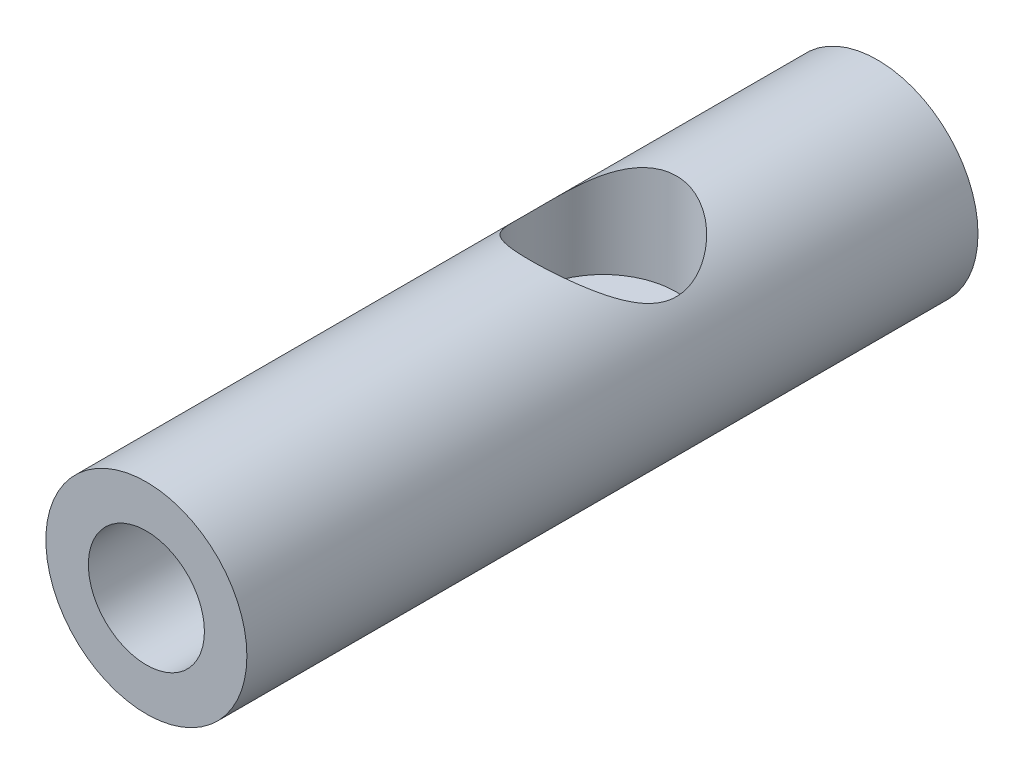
from build123d import *

# Parameters (mm, degrees)
SKETCH1_R           = 5.5
BOSS_EXTRUDE1_DEPTH = 20
SKETCH2_R           = 4
CUT_EXTRUDE1_DEPTH  = 22.459263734
SKETCH3_R           = 3.175
CUT_EXTRUDE2_DEPTH  = 5.7
SKETCH4_R           = 3.2
CUT_EXTRUDE3_DEPTH  = 3


with BuildPart() as part:
    # Sketch1 → Boss-Extrude1 (new, symmetric)
    with BuildSketch(Plane.XY):
        Circle(SKETCH1_R)
    extrude(amount=BOSS_EXTRUDE1_DEPTH, both=True)

    # Sketch2 → Cut-Extrude1 (cut, through all)
    with BuildSketch(Plane(origin=(0, 0, 0), x_dir=(1, 0, 0), z_dir=(0, 1, 0))):
        with Locations(Location((0, 5, 0), (0, 0, 90))):
            Circle(SKETCH2_R)
    extrude(amount=CUT_EXTRUDE1_DEPTH, mode=Mode.SUBTRACT)

    # Sketch3 → Cut-Extrude2 (cut)
    with BuildSketch(Plane.XY.offset(20)):
        Circle(SKETCH3_R)
    extrude(amount=-CUT_EXTRUDE2_DEPTH, mode=Mode.SUBTRACT)

    # Sketch4 → Cut-Extrude3 (cut)
    with BuildSketch(Plane(origin=(0, 0, -20), x_dir=(-1, 0, 0), z_dir=(0, 0, -1))):
        Circle(SKETCH4_R)
    extrude(amount=-CUT_EXTRUDE3_DEPTH, mode=Mode.SUBTRACT)


solid = part.part
